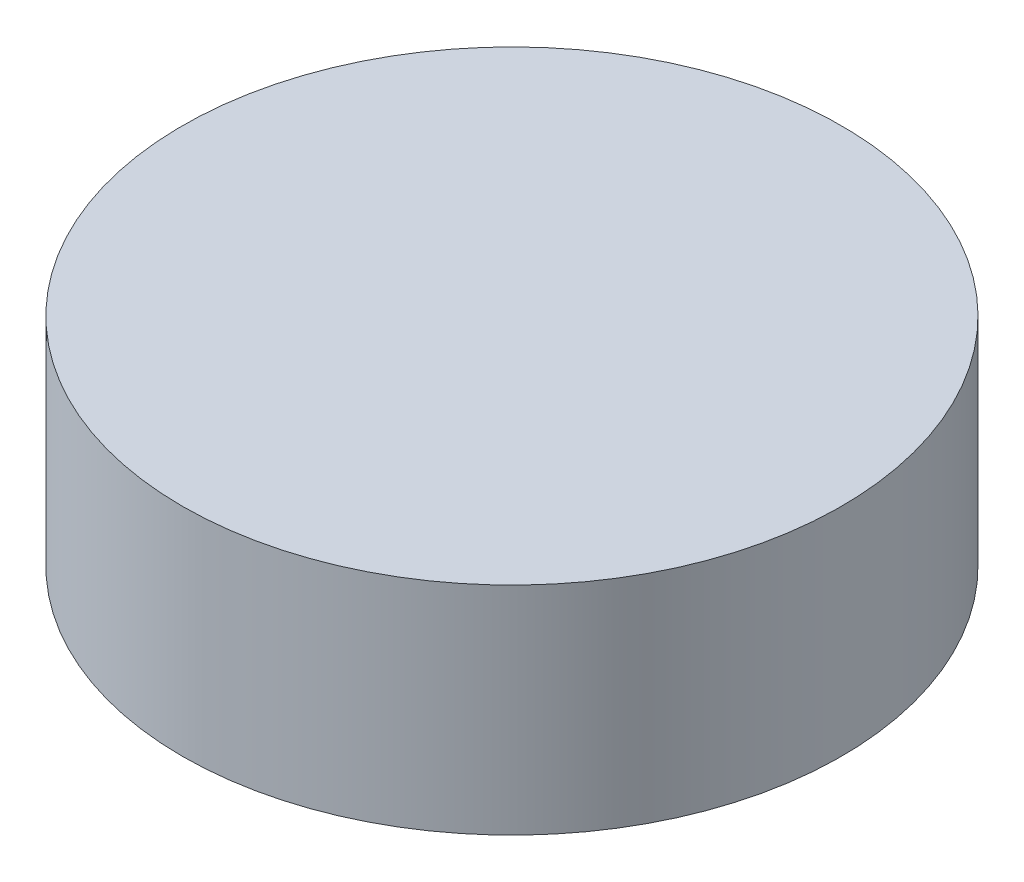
from build123d import *

# Parameters (mm, degrees)
SKETCH1_R           = 8.89
BOSS_EXTRUDE1_DEPTH = 2.921
SKETCH2_R           = 3.81
CUT_EXTRUDE1_DEPTH  = 5.08


with BuildPart() as part:
    # Sketch1 → Boss-Extrude1 (new, symmetric)
    with BuildSketch(Plane(origin=(0, 0, 0), x_dir=(1, 0, 0), z_dir=(0, 1, 0))):
        with Locations(Location((0, 0, 0), (0, 0, 270))):
            Circle(SKETCH1_R)
    extrude(amount=BOSS_EXTRUDE1_DEPTH, both=True)

    # Sketch2 → Cut-Extrude1 (cut)
    with BuildSketch(Plane(origin=(0, -2.921, 0), x_dir=(-1, 0, 0), z_dir=(0, -1, 0))):
        with Locations(Location((0, 0, 0), (0, 0, 90))):
            Circle(SKETCH2_R)
    extrude(amount=-CUT_EXTRUDE1_DEPTH, mode=Mode.SUBTRACT)


solid = part.part
